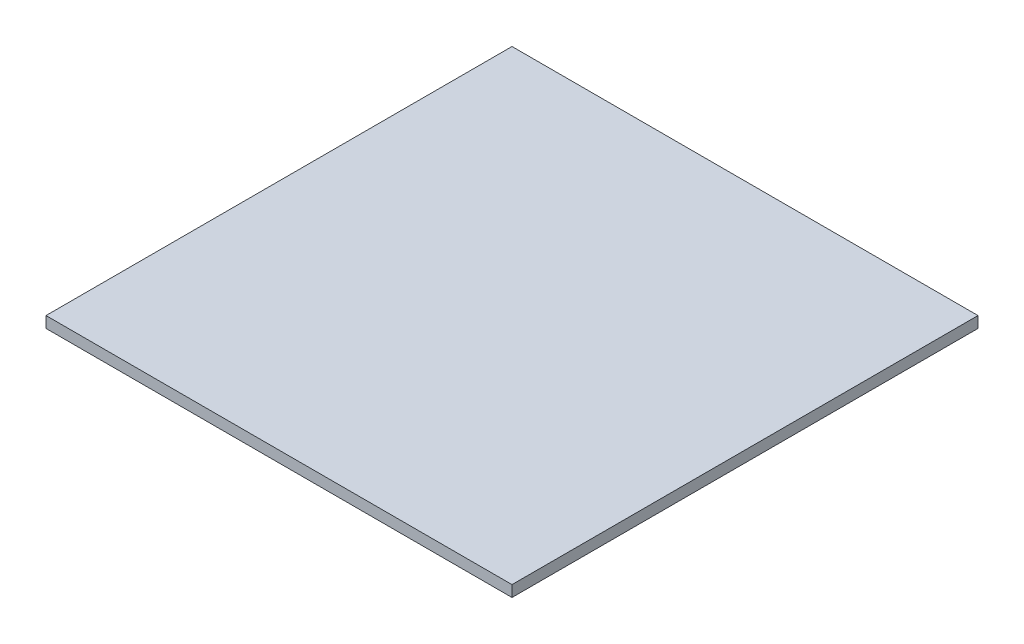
from build123d import *

# Parameters (mm, degrees)
ESBO_O1_W                = 238
ESBO_O1_H                = 250
RESSALTO_EXTRUS_O1_DEPTH = 6
ESBO_O2_W                = 250
ESBO_O2_H                = 6
RESSALTO_EXTRUS_O2_DEPTH = 12


with BuildPart() as part:
    # Esbo_o1 → Ressalto-extrus_o1 (new body)
    with BuildSketch(Plane(origin=(0, 0, 0), x_dir=(1, 0, 0), z_dir=(0, 1, 0))):
        with Locations((119, 125)):
            Rectangle(ESBO_O1_W, ESBO_O1_H)
    extrude(amount=RESSALTO_EXTRUS_O1_DEPTH)

    # Esbo_o2 → Ressalto-extrus_o2 (add)
    with BuildSketch(Plane.ZY):
        with Locations((-125, 3)):
            Rectangle(ESBO_O2_W, ESBO_O2_H)
    extrude(amount=RESSALTO_EXTRUS_O2_DEPTH)


solid = part.part
